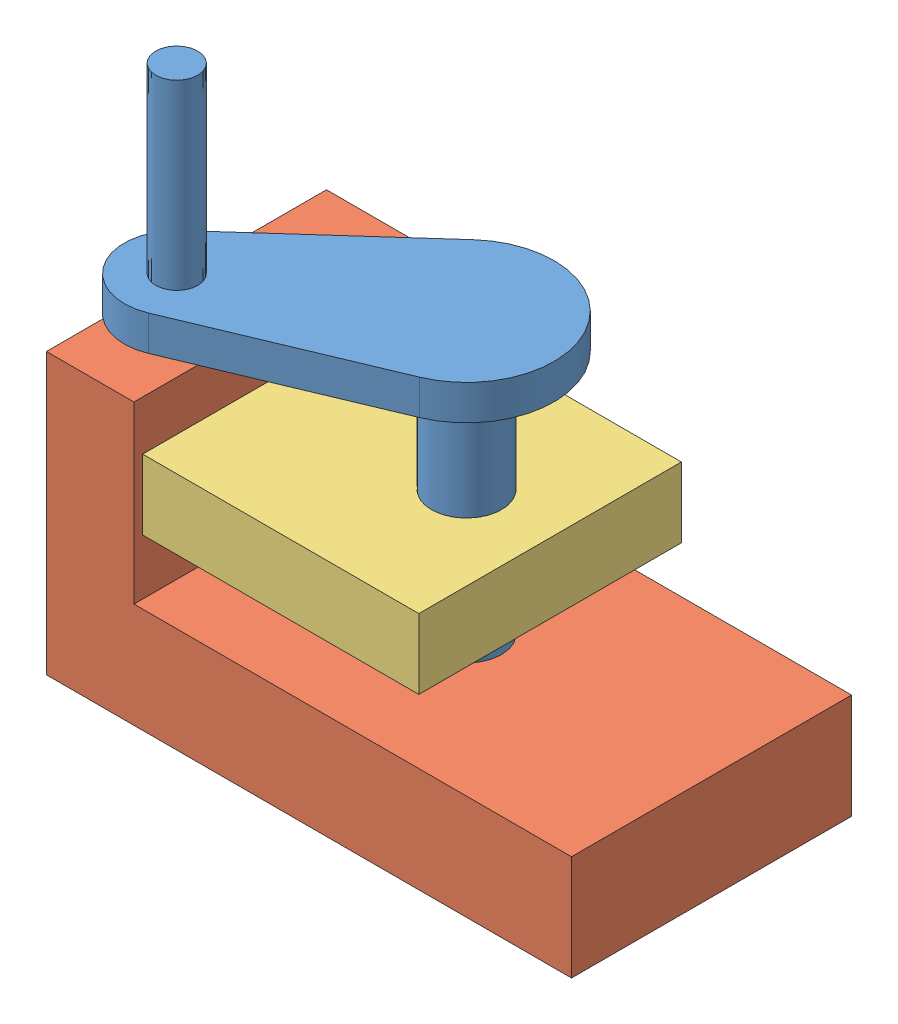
SolidWorks assembly kurbelbaugruppe.SLDASM, configuration Standard (file format 3100). Lengths in mm.
Overall size (150 162 101.21).
3 component instances, 3 part files, 7 mates.
Components (placement in the parent):
- Kurbel-2: Kurbel.sldprt [Standard] at (-18.7138 9.6239 11.8316) x (-0.845238 0 0.534391) z (-0.534391 0 -0.845238) size (100 162 50)
- Gestell-2: Gestell.sldprt [Standard] at (-17.4401 8.5137 0) size (150 80 80)
- Block-2: Block.sldprt [Standard] at (-19.0393 -15.8022 0) size (78.88 20 75)
Mates (geometry in assembly coordinates):
- VerknüpfungaufSkizzeFixieren2: unknown aligned: unknown of Gestell-2; unknown of Gestell-2
- VerknüpfungaufSkizzeFixieren3: unknown aligned: unknown of ?; unknown of ?
- Parallel1: parallel anti-aligned: plane of Gestell-2 through (-55 30 40) normal (1 0 0); plane of Block-2 through (-55 65.8448 37.5) normal (-1 0 0)
- Konzentrisch1: concentric aligned: cylinder of Kurbel-2; cylinder of Gestell-2
- Deckungsgleich2: coincident aligned: plane of Kurbel-2 through (0 0 0) normal (0 -1 0); plane of Gestell-2 through (-80 0 40) normal (0 -1 0)
- Konzentrisch2: concentric aligned: cylinder of Kurbel-2; cylinder of Block-2
- Deckungsgleich3: coincident = 20 mm: face of Kurbel-2; point of Block-2; sketch_entity of assembly
